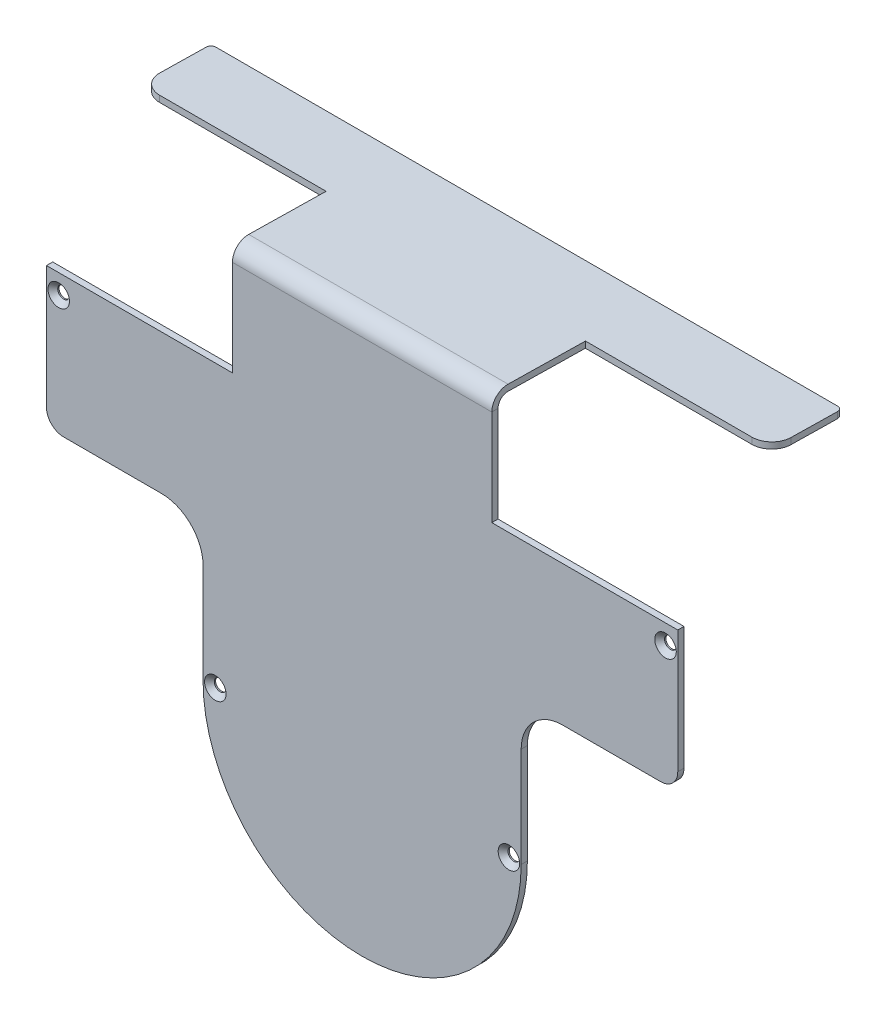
ISO-10303-21;
HEADER;
FILE_DESCRIPTION(('STEP AP214'),'2;1');
FILE_NAME('part.step','',(''),(''),'','','');
FILE_SCHEMA(('AUTOMOTIVE_DESIGN { 1 0 10303 214 1 1 1 1 }'));
ENDSEC;
DATA;
#1=APPLICATION_CONTEXT('core data for automotive mechanical design processes');
#2=APPLICATION_PROTOCOL_DEFINITION('international standard','automotive_design',2000,#1);
#3=PRODUCT_CONTEXT('',#1,'mechanical');
#4=PRODUCT('Part','Part','',(#3));
#5=PRODUCT_RELATED_PRODUCT_CATEGORY('part','',(#4));
#6=PRODUCT_DEFINITION_FORMATION('','',#4);
#7=PRODUCT_DEFINITION_CONTEXT('part definition',#1,'design');
#8=PRODUCT_DEFINITION('design','',#6,#7);
#9=PRODUCT_DEFINITION_SHAPE('','',#8);
#10=(LENGTH_UNIT() NAMED_UNIT(*) SI_UNIT(.MILLI.,.METRE.));
#11=(NAMED_UNIT(*) PLANE_ANGLE_UNIT() SI_UNIT($,.RADIAN.));
#12=(NAMED_UNIT(*) SI_UNIT($,.STERADIAN.) SOLID_ANGLE_UNIT());
#13=UNCERTAINTY_MEASURE_WITH_UNIT(LENGTH_MEASURE(1.E-05),#10,'distance_accuracy_value','');
#14=(GEOMETRIC_REPRESENTATION_CONTEXT(3) GLOBAL_UNCERTAINTY_ASSIGNED_CONTEXT((#13)) GLOBAL_UNIT_ASSIGNED_CONTEXT((#10,
#11,#12)) REPRESENTATION_CONTEXT('',''));
#15=CARTESIAN_POINT('',(0.,0.,0.));
#16=DIRECTION('',(0.,0.,1.));
#17=DIRECTION('',(1.,0.,0.));
#18=AXIS2_PLACEMENT_3D('',#15,#16,#17);
#19=CARTESIAN_POINT('',(0.,0.,1.27));
#20=DIRECTION('',(0.,0.,1.));
#21=DIRECTION('',(1.,0.,0.));
#22=AXIS2_PLACEMENT_3D('',#19,#20,#21);
#23=PLANE('',#22);
#24=CARTESIAN_POINT('',(-30.,0.,1.27));
#25=DIRECTION('',(0.,0.,1.));
#26=DIRECTION('',(1.,0.,0.));
#27=AXIS2_PLACEMENT_3D('',#24,#25,#26);
#28=CIRCLE('',#27,2.2);
#29=CARTESIAN_POINT('',(-27.8,0.,1.27));
#30=VERTEX_POINT('',#29);
#31=EDGE_CURVE('E256',#30,#30,#28,.T.);
#32=ORIENTED_EDGE('',*,*,#31,.F.);
#33=EDGE_LOOP('',(#32));
#34=FACE_BOUND('',#33,.T.);
#35=CARTESIAN_POINT('',(30.,0.,1.27));
#36=DIRECTION('',(0.,0.,1.));
#37=DIRECTION('',(1.,0.,0.));
#38=AXIS2_PLACEMENT_3D('',#35,#36,#37);
#39=CIRCLE('',#38,2.2);
#40=CARTESIAN_POINT('',(32.2,0.,1.27));
#41=VERTEX_POINT('',#40);
#42=EDGE_CURVE('E263',#41,#41,#39,.T.);
#43=ORIENTED_EDGE('',*,*,#42,.F.);
#44=EDGE_LOOP('',(#43));
#45=FACE_BOUND('',#44,.T.);
#46=CARTESIAN_POINT('',(-62.,53.5,1.27));
#47=DIRECTION('',(0.,0.,1.));
#48=DIRECTION('',(1.,0.,0.));
#49=AXIS2_PLACEMENT_3D('',#46,#47,#48);
#50=CIRCLE('',#49,2.2);
#51=CARTESIAN_POINT('',(-59.8,53.5,1.27));
#52=VERTEX_POINT('',#51);
#53=EDGE_CURVE('E270',#52,#52,#50,.T.);
#54=ORIENTED_EDGE('',*,*,#53,.F.);
#55=EDGE_LOOP('',(#54));
#56=FACE_BOUND('',#55,.T.);
#57=CARTESIAN_POINT('',(62.,53.5,1.27));
#58=DIRECTION('',(0.,0.,1.));
#59=DIRECTION('',(1.,0.,0.));
#60=AXIS2_PLACEMENT_3D('',#57,#58,#59);
#61=CIRCLE('',#60,2.2);
#62=CARTESIAN_POINT('',(64.2,53.5,1.27));
#63=VERTEX_POINT('',#62);
#64=EDGE_CURVE('E277',#63,#63,#61,.T.);
#65=ORIENTED_EDGE('',*,*,#64,.F.);
#66=EDGE_LOOP('',(#65));
#67=FACE_BOUND('',#66,.T.);
#68=DIRECTION('',(0.,1.,0.));
#69=VECTOR('',#68,1.);
#70=CARTESIAN_POINT('',(26.5,79.107,1.27));
#71=LINE('',#70,#69);
#72=CARTESIAN_POINT('',(26.5,57.5,1.27));
#73=VERTEX_POINT('',#72);
#74=CARTESIAN_POINT('',(26.5,77.0717852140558,1.26999999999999));
#75=VERTEX_POINT('',#74);
#76=EDGE_CURVE('E305',#73,#75,#71,.T.);
#77=ORIENTED_EDGE('',*,*,#76,.T.);
#78=DIRECTION('',(1.,0.,0.));
#79=VECTOR('',#78,1.);
#80=CARTESIAN_POINT('',(26.5,77.0717852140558,1.26999999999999));
#81=LINE('',#80,#79);
#82=CARTESIAN_POINT('',(-26.5,77.0717852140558,1.27));
#83=VERTEX_POINT('',#82);
#84=EDGE_CURVE('E286',#75,#83,#81,.F.);
#85=ORIENTED_EDGE('',*,*,#84,.T.);
#86=DIRECTION('',(0.,-1.,0.));
#87=VECTOR('',#86,1.);
#88=CARTESIAN_POINT('',(-26.5,79.107,1.27));
#89=LINE('',#88,#87);
#90=CARTESIAN_POINT('',(-26.5,57.5,1.27));
#91=VERTEX_POINT('',#90);
#92=EDGE_CURVE('E323',#83,#91,#89,.T.);
#93=ORIENTED_EDGE('',*,*,#92,.T.);
#94=DIRECTION('',(-1.,0.,0.));
#95=VECTOR('',#94,1.);
#96=CARTESIAN_POINT('',(-26.5,57.5,1.27));
#97=LINE('',#96,#95);
#98=CARTESIAN_POINT('',(-64.5000494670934,57.5,1.27));
#99=VERTEX_POINT('',#98);
#100=EDGE_CURVE('E325',#91,#99,#97,.T.);
#101=ORIENTED_EDGE('',*,*,#100,.T.);
#102=DIRECTION('',(0.,-1.,0.));
#103=VECTOR('',#102,1.);
#104=CARTESIAN_POINT('',(-64.5000494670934,32.40952187,1.27));
#105=LINE('',#104,#103);
#106=CARTESIAN_POINT('',(-64.5000494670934,32.40952187,1.27));
#107=VERTEX_POINT('',#106);
#108=EDGE_CURVE('E355',#99,#107,#105,.T.);
#109=ORIENTED_EDGE('',*,*,#108,.T.);
#110=CARTESIAN_POINT('',(-61.0000494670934,32.40952187,1.27));
#111=DIRECTION('',(0.,0.,1.));
#112=DIRECTION('',(-1.,0.,0.));
#113=AXIS2_PLACEMENT_3D('',#110,#111,#112);
#114=CIRCLE('',#113,3.5);
#115=CARTESIAN_POINT('',(-61.0000494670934,28.90952187,1.27));
#116=VERTEX_POINT('',#115);
#117=EDGE_CURVE('E357',#107,#116,#114,.T.);
#118=ORIENTED_EDGE('',*,*,#117,.T.);
#119=DIRECTION('',(1.,0.,0.));
#120=VECTOR('',#119,1.);
#121=CARTESIAN_POINT('',(-41.,28.90952187,1.27));
#122=LINE('',#121,#120);
#123=CARTESIAN_POINT('',(-41.,28.90952187,1.27));
#124=VERTEX_POINT('',#123);
#125=EDGE_CURVE('E359',#116,#124,#122,.T.);
#126=ORIENTED_EDGE('',*,*,#125,.T.);
#127=CARTESIAN_POINT('',(-41.,20.40952187,1.27));
#128=DIRECTION('',(0.,0.,-1.));
#129=DIRECTION('',(-1.,0.,0.));
#130=AXIS2_PLACEMENT_3D('',#127,#128,#129);
#131=CIRCLE('',#130,8.5);
#132=CARTESIAN_POINT('',(-32.5,20.40952187,1.27));
#133=VERTEX_POINT('',#132);
#134=EDGE_CURVE('E361',#124,#133,#131,.T.);
#135=ORIENTED_EDGE('',*,*,#134,.T.);
#136=DIRECTION('',(0.,-1.,0.));
#137=VECTOR('',#136,1.);
#138=CARTESIAN_POINT('',(-32.5,0.,1.27));
#139=LINE('',#138,#137);
#140=CARTESIAN_POINT('',(-32.5,0.,1.27));
#141=VERTEX_POINT('',#140);
#142=EDGE_CURVE('E363',#133,#141,#139,.T.);
#143=ORIENTED_EDGE('',*,*,#142,.T.);
#144=CARTESIAN_POINT('',(0.,0.,1.27));
#145=DIRECTION('',(0.,0.,1.));
#146=DIRECTION('',(1.,0.,0.));
#147=AXIS2_PLACEMENT_3D('',#144,#145,#146);
#148=CIRCLE('',#147,32.5);
#149=CARTESIAN_POINT('',(32.5,0.,1.27));
#150=VERTEX_POINT('',#149);
#151=EDGE_CURVE('E341',#141,#150,#148,.T.);
#152=ORIENTED_EDGE('',*,*,#151,.T.);
#153=DIRECTION('',(0.,1.,0.));
#154=VECTOR('',#153,1.);
#155=CARTESIAN_POINT('',(32.5,0.,1.27));
#156=LINE('',#155,#154);
#157=CARTESIAN_POINT('',(32.5,20.40952187,1.27));
#158=VERTEX_POINT('',#157);
#159=EDGE_CURVE('E344',#150,#158,#156,.T.);
#160=ORIENTED_EDGE('',*,*,#159,.T.);
#161=CARTESIAN_POINT('',(41.,20.40952187,1.27));
#162=DIRECTION('',(0.,0.,-1.));
#163=DIRECTION('',(1.,0.,0.));
#164=AXIS2_PLACEMENT_3D('',#161,#162,#163);
#165=CIRCLE('',#164,8.5);
#166=CARTESIAN_POINT('',(41.,28.90952187,1.27));
#167=VERTEX_POINT('',#166);
#168=EDGE_CURVE('E347',#158,#167,#165,.T.);
#169=ORIENTED_EDGE('',*,*,#168,.T.);
#170=DIRECTION('',(1.,0.,0.));
#171=VECTOR('',#170,1.);
#172=CARTESIAN_POINT('',(41.,28.90952187,1.27));
#173=LINE('',#172,#171);
#174=CARTESIAN_POINT('',(61.0000494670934,28.90952187,1.27));
#175=VERTEX_POINT('',#174);
#176=EDGE_CURVE('E349',#167,#175,#173,.T.);
#177=ORIENTED_EDGE('',*,*,#176,.T.);
#178=CARTESIAN_POINT('',(61.0000494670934,32.40952187,1.27));
#179=DIRECTION('',(0.,0.,1.));
#180=DIRECTION('',(1.,0.,0.));
#181=AXIS2_PLACEMENT_3D('',#178,#179,#180);
#182=CIRCLE('',#181,3.5);
#183=CARTESIAN_POINT('',(64.5000494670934,32.40952187,1.27));
#184=VERTEX_POINT('',#183);
#185=EDGE_CURVE('E351',#175,#184,#182,.T.);
#186=ORIENTED_EDGE('',*,*,#185,.T.);
#187=DIRECTION('',(0.,1.,0.));
#188=VECTOR('',#187,1.);
#189=CARTESIAN_POINT('',(64.5000494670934,32.40952187,1.27));
#190=LINE('',#189,#188);
#191=CARTESIAN_POINT('',(64.5000494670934,57.5,1.27));
#192=VERTEX_POINT('',#191);
#193=EDGE_CURVE('E353',#184,#192,#190,.T.);
#194=ORIENTED_EDGE('',*,*,#193,.T.);
#195=DIRECTION('',(-1.,0.,0.));
#196=VECTOR('',#195,1.);
#197=CARTESIAN_POINT('',(26.5,57.5,1.27));
#198=LINE('',#197,#196);
#199=EDGE_CURVE('E312',#192,#73,#198,.T.);
#200=ORIENTED_EDGE('',*,*,#199,.T.);
#201=EDGE_LOOP('',(#77,#85,#93,#101,#109,#118,#126,#135,#143,#152,#160,#169,#177,#186,#194,#200));
#202=FACE_BOUND('',#201,.T.);
#203=ADVANCED_FACE('F16',(#34,#45,#56,#67,#202),#23,.T.);
#204=CARTESIAN_POINT('',(0.,0.,0.));
#205=DIRECTION('',(0.,0.,1.));
#206=DIRECTION('',(1.,0.,0.));
#207=AXIS2_PLACEMENT_3D('',#204,#205,#206);
#208=PLANE('',#207);
#209=CARTESIAN_POINT('',(-30.,0.,0.));
#210=DIRECTION('',(0.,0.,1.));
#211=DIRECTION('',(1.,0.,0.));
#212=AXIS2_PLACEMENT_3D('',#209,#210,#211);
#213=CIRCLE('',#212,1.19999999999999);
#214=CARTESIAN_POINT('',(-28.8,0.,0.));
#215=VERTEX_POINT('',#214);
#216=EDGE_CURVE('E259',#215,#215,#213,.T.);
#217=ORIENTED_EDGE('',*,*,#216,.T.);
#218=EDGE_LOOP('',(#217));
#219=FACE_BOUND('',#218,.T.);
#220=CARTESIAN_POINT('',(30.,0.,0.));
#221=DIRECTION('',(0.,0.,1.));
#222=DIRECTION('',(1.,0.,0.));
#223=AXIS2_PLACEMENT_3D('',#220,#221,#222);
#224=CIRCLE('',#223,1.19999999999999);
#225=CARTESIAN_POINT('',(31.2,0.,0.));
#226=VERTEX_POINT('',#225);
#227=EDGE_CURVE('E266',#226,#226,#224,.T.);
#228=ORIENTED_EDGE('',*,*,#227,.T.);
#229=EDGE_LOOP('',(#228));
#230=FACE_BOUND('',#229,.T.);
#231=CARTESIAN_POINT('',(-62.,53.5,0.));
#232=DIRECTION('',(0.,0.,1.));
#233=DIRECTION('',(1.,0.,0.));
#234=AXIS2_PLACEMENT_3D('',#231,#232,#233);
#235=CIRCLE('',#234,1.19999999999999);
#236=CARTESIAN_POINT('',(-60.8,53.5,0.));
#237=VERTEX_POINT('',#236);
#238=EDGE_CURVE('E273',#237,#237,#235,.T.);
#239=ORIENTED_EDGE('',*,*,#238,.T.);
#240=EDGE_LOOP('',(#239));
#241=FACE_BOUND('',#240,.T.);
#242=CARTESIAN_POINT('',(62.,53.5,0.));
#243=DIRECTION('',(0.,0.,1.));
#244=DIRECTION('',(1.,0.,0.));
#245=AXIS2_PLACEMENT_3D('',#242,#243,#244);
#246=CIRCLE('',#245,1.19999999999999);
#247=CARTESIAN_POINT('',(63.2,53.5,0.));
#248=VERTEX_POINT('',#247);
#249=EDGE_CURVE('E280',#248,#248,#246,.T.);
#250=ORIENTED_EDGE('',*,*,#249,.T.);
#251=EDGE_LOOP('',(#250));
#252=FACE_BOUND('',#251,.T.);
#253=DIRECTION('',(1.,0.,0.));
#254=VECTOR('',#253,1.);
#255=CARTESIAN_POINT('',(26.5,77.0717852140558,0.));
#256=LINE('',#255,#254);
#257=CARTESIAN_POINT('',(26.5,77.0717852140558,0.));
#258=VERTEX_POINT('',#257);
#259=CARTESIAN_POINT('',(-26.5,77.0717852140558,0.));
#260=VERTEX_POINT('',#259);
#261=EDGE_CURVE('E298',#258,#260,#256,.F.);
#262=ORIENTED_EDGE('',*,*,#261,.F.);
#263=DIRECTION('',(0.,1.,0.));
#264=VECTOR('',#263,1.);
#265=CARTESIAN_POINT('',(26.5,79.107,0.));
#266=LINE('',#265,#264);
#267=CARTESIAN_POINT('',(26.5,57.5,0.));
#268=VERTEX_POINT('',#267);
#269=EDGE_CURVE('E308',#268,#258,#266,.T.);
#270=ORIENTED_EDGE('',*,*,#269,.F.);
#271=DIRECTION('',(-1.,0.,0.));
#272=VECTOR('',#271,1.);
#273=CARTESIAN_POINT('',(26.5,57.5,0.));
#274=LINE('',#273,#272);
#275=CARTESIAN_POINT('',(64.5000494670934,57.5,0.));
#276=VERTEX_POINT('',#275);
#277=EDGE_CURVE('E317',#276,#268,#274,.T.);
#278=ORIENTED_EDGE('',*,*,#277,.F.);
#279=DIRECTION('',(0.,1.,0.));
#280=VECTOR('',#279,1.);
#281=CARTESIAN_POINT('',(64.5000494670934,32.40952187,0.));
#282=LINE('',#281,#280);
#283=CARTESIAN_POINT('',(64.5000494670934,32.40952187,0.));
#284=VERTEX_POINT('',#283);
#285=EDGE_CURVE('E376',#284,#276,#282,.T.);
#286=ORIENTED_EDGE('',*,*,#285,.F.);
#287=CARTESIAN_POINT('',(61.0000494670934,32.40952187,0.));
#288=DIRECTION('',(0.,0.,1.));
#289=DIRECTION('',(1.,0.,0.));
#290=AXIS2_PLACEMENT_3D('',#287,#288,#289);
#291=CIRCLE('',#290,3.5);
#292=CARTESIAN_POINT('',(61.0000494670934,28.90952187,0.));
#293=VERTEX_POINT('',#292);
#294=EDGE_CURVE('E374',#293,#284,#291,.T.);
#295=ORIENTED_EDGE('',*,*,#294,.F.);
#296=DIRECTION('',(1.,0.,0.));
#297=VECTOR('',#296,1.);
#298=CARTESIAN_POINT('',(41.,28.90952187,0.));
#299=LINE('',#298,#297);
#300=CARTESIAN_POINT('',(41.,28.90952187,0.));
#301=VERTEX_POINT('',#300);
#302=EDGE_CURVE('E372',#301,#293,#299,.T.);
#303=ORIENTED_EDGE('',*,*,#302,.F.);
#304=CARTESIAN_POINT('',(41.,20.40952187,0.));
#305=DIRECTION('',(0.,0.,-1.));
#306=DIRECTION('',(1.,0.,0.));
#307=AXIS2_PLACEMENT_3D('',#304,#305,#306);
#308=CIRCLE('',#307,8.5);
#309=CARTESIAN_POINT('',(32.5,20.40952187,0.));
#310=VERTEX_POINT('',#309);
#311=EDGE_CURVE('E370',#310,#301,#308,.T.);
#312=ORIENTED_EDGE('',*,*,#311,.F.);
#313=DIRECTION('',(0.,1.,0.));
#314=VECTOR('',#313,1.);
#315=CARTESIAN_POINT('',(32.5,0.,0.));
#316=LINE('',#315,#314);
#317=CARTESIAN_POINT('',(32.5,0.,0.));
#318=VERTEX_POINT('',#317);
#319=EDGE_CURVE('E368',#318,#310,#316,.T.);
#320=ORIENTED_EDGE('',*,*,#319,.F.);
#321=CARTESIAN_POINT('',(0.,0.,0.));
#322=DIRECTION('',(0.,0.,1.));
#323=DIRECTION('',(1.,0.,0.));
#324=AXIS2_PLACEMENT_3D('',#321,#322,#323);
#325=CIRCLE('',#324,32.5);
#326=CARTESIAN_POINT('',(-32.5,0.,0.));
#327=VERTEX_POINT('',#326);
#328=EDGE_CURVE('E332',#327,#318,#325,.T.);
#329=ORIENTED_EDGE('',*,*,#328,.F.);
#330=DIRECTION('',(0.,-1.,0.));
#331=VECTOR('',#330,1.);
#332=CARTESIAN_POINT('',(-32.5,0.,0.));
#333=LINE('',#332,#331);
#334=CARTESIAN_POINT('',(-32.5,20.40952187,0.));
#335=VERTEX_POINT('',#334);
#336=EDGE_CURVE('E345',#335,#327,#333,.T.);
#337=ORIENTED_EDGE('',*,*,#336,.F.);
#338=CARTESIAN_POINT('',(-41.,20.40952187,0.));
#339=DIRECTION('',(0.,0.,-1.));
#340=DIRECTION('',(-1.,0.,0.));
#341=AXIS2_PLACEMENT_3D('',#338,#339,#340);
#342=CIRCLE('',#341,8.5);
#343=CARTESIAN_POINT('',(-41.,28.90952187,0.));
#344=VERTEX_POINT('',#343);
#345=EDGE_CURVE('E384',#344,#335,#342,.T.);
#346=ORIENTED_EDGE('',*,*,#345,.F.);
#347=DIRECTION('',(1.,0.,0.));
#348=VECTOR('',#347,1.);
#349=CARTESIAN_POINT('',(-41.,28.90952187,0.));
#350=LINE('',#349,#348);
#351=CARTESIAN_POINT('',(-61.0000494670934,28.90952187,0.));
#352=VERTEX_POINT('',#351);
#353=EDGE_CURVE('E382',#352,#344,#350,.T.);
#354=ORIENTED_EDGE('',*,*,#353,.F.);
#355=CARTESIAN_POINT('',(-61.0000494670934,32.40952187,0.));
#356=DIRECTION('',(0.,0.,1.));
#357=DIRECTION('',(-1.,0.,0.));
#358=AXIS2_PLACEMENT_3D('',#355,#356,#357);
#359=CIRCLE('',#358,3.5);
#360=CARTESIAN_POINT('',(-64.5000494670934,32.40952187,0.));
#361=VERTEX_POINT('',#360);
#362=EDGE_CURVE('E380',#361,#352,#359,.T.);
#363=ORIENTED_EDGE('',*,*,#362,.F.);
#364=DIRECTION('',(0.,-1.,0.));
#365=VECTOR('',#364,1.);
#366=CARTESIAN_POINT('',(-64.5000494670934,32.40952187,0.));
#367=LINE('',#366,#365);
#368=CARTESIAN_POINT('',(-64.5000494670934,57.5,0.));
#369=VERTEX_POINT('',#368);
#370=EDGE_CURVE('E378',#369,#361,#367,.T.);
#371=ORIENTED_EDGE('',*,*,#370,.F.);
#372=DIRECTION('',(-1.,0.,0.));
#373=VECTOR('',#372,1.);
#374=CARTESIAN_POINT('',(-26.5,57.5,0.));
#375=LINE('',#374,#373);
#376=CARTESIAN_POINT('',(-26.5,57.5,0.));
#377=VERTEX_POINT('',#376);
#378=EDGE_CURVE('E314',#377,#369,#375,.T.);
#379=ORIENTED_EDGE('',*,*,#378,.F.);
#380=DIRECTION('',(0.,-1.,0.));
#381=VECTOR('',#380,1.);
#382=CARTESIAN_POINT('',(-26.5,79.107,0.));
#383=LINE('',#382,#381);
#384=EDGE_CURVE('E311',#260,#377,#383,.T.);
#385=ORIENTED_EDGE('',*,*,#384,.F.);
#386=EDGE_LOOP('',(#262,#270,#278,#286,#295,#303,#312,#320,#329,#337,#346,#354,#363,#371,#379,#385));
#387=FACE_BOUND('',#386,.T.);
#388=ADVANCED_FACE('F496',(#219,#230,#241,#252,#387),#208,.F.);
#389=CARTESIAN_POINT('',(26.5,79.107,0.));
#390=DIRECTION('',(1.,0.,0.));
#391=DIRECTION('',(0.,1.,0.));
#392=AXIS2_PLACEMENT_3D('',#389,#390,#391);
#393=PLANE('',#392);
#394=ORIENTED_EDGE('',*,*,#269,.T.);
#395=DIRECTION('',(0.,0.,1.));
#396=VECTOR('',#395,1.);
#397=CARTESIAN_POINT('',(26.5,77.0717852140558,0.));
#398=LINE('',#397,#396);
#399=EDGE_CURVE('E293',#258,#75,#398,.T.);
#400=ORIENTED_EDGE('',*,*,#399,.T.);
#401=ORIENTED_EDGE('',*,*,#76,.F.);
#402=DIRECTION('',(0.,0.,1.));
#403=VECTOR('',#402,1.);
#404=CARTESIAN_POINT('',(26.5,57.5,0.));
#405=LINE('',#404,#403);
#406=EDGE_CURVE('E330',#268,#73,#405,.T.);
#407=ORIENTED_EDGE('',*,*,#406,.F.);
#408=EDGE_LOOP('',(#394,#400,#401,#407));
#409=FACE_BOUND('',#408,.T.);
#410=ADVANCED_FACE('F491',(#409),#393,.T.);
#411=CARTESIAN_POINT('',(0.,0.,1.27));
#412=DIRECTION('',(0.,0.,-1.));
#413=DIRECTION('',(-1.,0.,0.));
#414=AXIS2_PLACEMENT_3D('',#411,#412,#413);
#415=CYLINDRICAL_SURFACE('',#414,32.5);
#416=ORIENTED_EDGE('',*,*,#328,.T.);
#417=DIRECTION('',(0.,0.,-1.));
#418=VECTOR('',#417,1.);
#419=CARTESIAN_POINT('',(32.5,0.,1.27));
#420=LINE('',#419,#418);
#421=EDGE_CURVE('E413',#150,#318,#420,.T.);
#422=ORIENTED_EDGE('',*,*,#421,.F.);
#423=ORIENTED_EDGE('',*,*,#151,.F.);
#424=DIRECTION('',(0.,0.,-1.));
#425=VECTOR('',#424,1.);
#426=CARTESIAN_POINT('',(-32.5,0.,1.27));
#427=LINE('',#426,#425);
#428=EDGE_CURVE('E365',#141,#327,#427,.T.);
#429=ORIENTED_EDGE('',*,*,#428,.T.);
#430=EDGE_LOOP('',(#416,#422,#423,#429));
#431=FACE_BOUND('',#430,.T.);
#432=ADVANCED_FACE('F528',(#431),#415,.T.);
#433=CARTESIAN_POINT('',(32.5,0.,1.27));
#434=DIRECTION('',(-1.,0.,0.));
#435=DIRECTION('',(0.,0.,1.));
#436=AXIS2_PLACEMENT_3D('',#433,#434,#435);
#437=PLANE('',#436);
#438=ORIENTED_EDGE('',*,*,#319,.T.);
#439=DIRECTION('',(0.,0.,-1.));
#440=VECTOR('',#439,1.);
#441=CARTESIAN_POINT('',(32.5,20.40952187,1.27));
#442=LINE('',#441,#440);
#443=EDGE_CURVE('E410',#158,#310,#442,.T.);
#444=ORIENTED_EDGE('',*,*,#443,.F.);
#445=ORIENTED_EDGE('',*,*,#159,.F.);
#446=ORIENTED_EDGE('',*,*,#421,.T.);
#447=EDGE_LOOP('',(#438,#444,#445,#446));
#448=FACE_BOUND('',#447,.T.);
#449=ADVANCED_FACE('F525',(#448),#437,.F.);
#450=CARTESIAN_POINT('',(41.,20.40952187,1.27));
#451=DIRECTION('',(0.,0.,-1.));
#452=DIRECTION('',(-1.,0.,0.));
#453=AXIS2_PLACEMENT_3D('',#450,#451,#452);
#454=CYLINDRICAL_SURFACE('',#453,8.5);
#455=ORIENTED_EDGE('',*,*,#311,.T.);
#456=DIRECTION('',(0.,0.,-1.));
#457=VECTOR('',#456,1.);
#458=CARTESIAN_POINT('',(41.,28.90952187,1.27));
#459=LINE('',#458,#457);
#460=EDGE_CURVE('E407',#167,#301,#459,.T.);
#461=ORIENTED_EDGE('',*,*,#460,.F.);
#462=ORIENTED_EDGE('',*,*,#168,.F.);
#463=ORIENTED_EDGE('',*,*,#443,.T.);
#464=EDGE_LOOP('',(#455,#461,#462,#463));
#465=FACE_BOUND('',#464,.T.);
#466=ADVANCED_FACE('F519',(#465),#454,.F.);
#467=CARTESIAN_POINT('',(41.,28.90952187,1.27));
#468=DIRECTION('',(0.,1.,0.));
#469=DIRECTION('',(-1.,0.,0.));
#470=AXIS2_PLACEMENT_3D('',#467,#468,#469);
#471=PLANE('',#470);
#472=ORIENTED_EDGE('',*,*,#302,.T.);
#473=DIRECTION('',(0.,0.,-1.));
#474=VECTOR('',#473,1.);
#475=CARTESIAN_POINT('',(61.0000494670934,28.90952187,1.27));
#476=LINE('',#475,#474);
#477=EDGE_CURVE('E404',#175,#293,#476,.T.);
#478=ORIENTED_EDGE('',*,*,#477,.F.);
#479=ORIENTED_EDGE('',*,*,#176,.F.);
#480=ORIENTED_EDGE('',*,*,#460,.T.);
#481=EDGE_LOOP('',(#472,#478,#479,#480));
#482=FACE_BOUND('',#481,.T.);
#483=ADVANCED_FACE('F515',(#482),#471,.F.);
#484=CARTESIAN_POINT('',(61.0000494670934,32.40952187,1.27));
#485=DIRECTION('',(0.,0.,-1.));
#486=DIRECTION('',(-1.,0.,0.));
#487=AXIS2_PLACEMENT_3D('',#484,#485,#486);
#488=CYLINDRICAL_SURFACE('',#487,3.5);
#489=ORIENTED_EDGE('',*,*,#294,.T.);
#490=DIRECTION('',(0.,0.,-1.));
#491=VECTOR('',#490,1.);
#492=CARTESIAN_POINT('',(64.5000494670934,32.40952187,1.27));
#493=LINE('',#492,#491);
#494=EDGE_CURVE('E401',#184,#284,#493,.T.);
#495=ORIENTED_EDGE('',*,*,#494,.F.);
#496=ORIENTED_EDGE('',*,*,#185,.F.);
#497=ORIENTED_EDGE('',*,*,#477,.T.);
#498=EDGE_LOOP('',(#489,#495,#496,#497));
#499=FACE_BOUND('',#498,.T.);
#500=ADVANCED_FACE('F510',(#499),#488,.T.);
#501=CARTESIAN_POINT('',(64.5000494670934,32.40952187,1.27));
#502=DIRECTION('',(-1.,0.,0.));
#503=DIRECTION('',(0.,0.,1.));
#504=AXIS2_PLACEMENT_3D('',#501,#502,#503);
#505=PLANE('',#504);
#506=ORIENTED_EDGE('',*,*,#285,.T.);
#507=DIRECTION('',(0.,0.,1.));
#508=VECTOR('',#507,1.);
#509=CARTESIAN_POINT('',(64.5000494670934,57.5,0.));
#510=LINE('',#509,#508);
#511=EDGE_CURVE('E333',#276,#192,#510,.T.);
#512=ORIENTED_EDGE('',*,*,#511,.T.);
#513=ORIENTED_EDGE('',*,*,#193,.F.);
#514=ORIENTED_EDGE('',*,*,#494,.T.);
#515=EDGE_LOOP('',(#506,#512,#513,#514));
#516=FACE_BOUND('',#515,.T.);
#517=ADVANCED_FACE('F504',(#516),#505,.F.);
#518=CARTESIAN_POINT('',(-64.5000494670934,32.40952187,1.27));
#519=DIRECTION('',(1.,0.,0.));
#520=DIRECTION('',(0.,0.,-1.));
#521=AXIS2_PLACEMENT_3D('',#518,#519,#520);
#522=PLANE('',#521);
#523=ORIENTED_EDGE('',*,*,#370,.T.);
#524=DIRECTION('',(0.,0.,-1.));
#525=VECTOR('',#524,1.);
#526=CARTESIAN_POINT('',(-64.5000494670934,32.40952187,1.27));
#527=LINE('',#526,#525);
#528=EDGE_CURVE('E398',#107,#361,#527,.T.);
#529=ORIENTED_EDGE('',*,*,#528,.F.);
#530=ORIENTED_EDGE('',*,*,#108,.F.);
#531=DIRECTION('',(0.,0.,1.));
#532=VECTOR('',#531,1.);
#533=CARTESIAN_POINT('',(-64.5000494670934,57.5,0.));
#534=LINE('',#533,#532);
#535=EDGE_CURVE('E336',#369,#99,#534,.T.);
#536=ORIENTED_EDGE('',*,*,#535,.F.);
#537=EDGE_LOOP('',(#523,#529,#530,#536));
#538=FACE_BOUND('',#537,.T.);
#539=ADVANCED_FACE('F552',(#538),#522,.F.);
#540=CARTESIAN_POINT('',(-61.0000494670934,32.40952187,1.27));
#541=DIRECTION('',(0.,0.,-1.));
#542=DIRECTION('',(-1.,0.,0.));
#543=AXIS2_PLACEMENT_3D('',#540,#541,#542);
#544=CYLINDRICAL_SURFACE('',#543,3.5);
#545=ORIENTED_EDGE('',*,*,#362,.T.);
#546=DIRECTION('',(0.,0.,-1.));
#547=VECTOR('',#546,1.);
#548=CARTESIAN_POINT('',(-61.0000494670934,28.90952187,1.27));
#549=LINE('',#548,#547);
#550=EDGE_CURVE('E395',#116,#352,#549,.T.);
#551=ORIENTED_EDGE('',*,*,#550,.F.);
#552=ORIENTED_EDGE('',*,*,#117,.F.);
#553=ORIENTED_EDGE('',*,*,#528,.T.);
#554=EDGE_LOOP('',(#545,#551,#552,#553));
#555=FACE_BOUND('',#554,.T.);
#556=ADVANCED_FACE('F547',(#555),#544,.T.);
#557=CARTESIAN_POINT('',(-41.,28.90952187,1.27));
#558=DIRECTION('',(0.,1.,0.));
#559=DIRECTION('',(-1.,0.,0.));
#560=AXIS2_PLACEMENT_3D('',#557,#558,#559);
#561=PLANE('',#560);
#562=ORIENTED_EDGE('',*,*,#353,.T.);
#563=DIRECTION('',(0.,0.,-1.));
#564=VECTOR('',#563,1.);
#565=CARTESIAN_POINT('',(-41.,28.90952187,1.27));
#566=LINE('',#565,#564);
#567=EDGE_CURVE('E392',#124,#344,#566,.T.);
#568=ORIENTED_EDGE('',*,*,#567,.F.);
#569=ORIENTED_EDGE('',*,*,#125,.F.);
#570=ORIENTED_EDGE('',*,*,#550,.T.);
#571=EDGE_LOOP('',(#562,#568,#569,#570));
#572=FACE_BOUND('',#571,.T.);
#573=ADVANCED_FACE('F543',(#572),#561,.F.);
#574=CARTESIAN_POINT('',(-41.,20.40952187,1.27));
#575=DIRECTION('',(0.,0.,-1.));
#576=DIRECTION('',(-1.,0.,0.));
#577=AXIS2_PLACEMENT_3D('',#574,#575,#576);
#578=CYLINDRICAL_SURFACE('',#577,8.5);
#579=ORIENTED_EDGE('',*,*,#345,.T.);
#580=DIRECTION('',(0.,0.,-1.));
#581=VECTOR('',#580,1.);
#582=CARTESIAN_POINT('',(-32.5,20.40952187,1.27));
#583=LINE('',#582,#581);
#584=EDGE_CURVE('E389',#133,#335,#583,.T.);
#585=ORIENTED_EDGE('',*,*,#584,.F.);
#586=ORIENTED_EDGE('',*,*,#134,.F.);
#587=ORIENTED_EDGE('',*,*,#567,.T.);
#588=EDGE_LOOP('',(#579,#585,#586,#587));
#589=FACE_BOUND('',#588,.T.);
#590=ADVANCED_FACE('F538',(#589),#578,.F.);
#591=CARTESIAN_POINT('',(-32.5,0.,1.27));
#592=DIRECTION('',(1.,0.,0.));
#593=DIRECTION('',(0.,0.,-1.));
#594=AXIS2_PLACEMENT_3D('',#591,#592,#593);
#595=PLANE('',#594);
#596=ORIENTED_EDGE('',*,*,#336,.T.);
#597=ORIENTED_EDGE('',*,*,#428,.F.);
#598=ORIENTED_EDGE('',*,*,#142,.F.);
#599=ORIENTED_EDGE('',*,*,#584,.T.);
#600=EDGE_LOOP('',(#596,#597,#598,#599));
#601=FACE_BOUND('',#600,.T.);
#602=ADVANCED_FACE('F532',(#601),#595,.F.);
#603=CARTESIAN_POINT('',(26.5,57.5,0.));
#604=DIRECTION('',(0.,1.,0.));
#605=DIRECTION('',(-1.,0.,0.));
#606=AXIS2_PLACEMENT_3D('',#603,#604,#605);
#607=PLANE('',#606);
#608=ORIENTED_EDGE('',*,*,#199,.F.);
#609=ORIENTED_EDGE('',*,*,#511,.F.);
#610=ORIENTED_EDGE('',*,*,#277,.T.);
#611=ORIENTED_EDGE('',*,*,#406,.T.);
#612=EDGE_LOOP('',(#608,#609,#610,#611));
#613=FACE_BOUND('',#612,.T.);
#614=ADVANCED_FACE('F501',(#613),#607,.T.);
#615=CARTESIAN_POINT('',(-26.5,57.5,0.));
#616=DIRECTION('',(0.,1.,0.));
#617=DIRECTION('',(-1.,0.,0.));
#618=AXIS2_PLACEMENT_3D('',#615,#616,#617);
#619=PLANE('',#618);
#620=ORIENTED_EDGE('',*,*,#100,.F.);
#621=DIRECTION('',(0.,0.,1.));
#622=VECTOR('',#621,1.);
#623=CARTESIAN_POINT('',(-26.5,57.5,0.));
#624=LINE('',#623,#622);
#625=EDGE_CURVE('E320',#377,#91,#624,.T.);
#626=ORIENTED_EDGE('',*,*,#625,.F.);
#627=ORIENTED_EDGE('',*,*,#378,.T.);
#628=ORIENTED_EDGE('',*,*,#535,.T.);
#629=EDGE_LOOP('',(#620,#626,#627,#628));
#630=FACE_BOUND('',#629,.T.);
#631=ADVANCED_FACE('F554',(#630),#619,.T.);
#632=CARTESIAN_POINT('',(-26.5,79.107,0.));
#633=DIRECTION('',(-1.,0.,0.));
#634=DIRECTION('',(0.,-1.,0.));
#635=AXIS2_PLACEMENT_3D('',#632,#633,#634);
#636=PLANE('',#635);
#637=DIRECTION('',(0.,0.,1.));
#638=VECTOR('',#637,1.);
#639=CARTESIAN_POINT('',(-26.5,77.0717852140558,0.));
#640=LINE('',#639,#638);
#641=EDGE_CURVE('E302',#260,#83,#640,.T.);
#642=ORIENTED_EDGE('',*,*,#641,.F.);
#643=ORIENTED_EDGE('',*,*,#384,.T.);
#644=ORIENTED_EDGE('',*,*,#625,.T.);
#645=ORIENTED_EDGE('',*,*,#92,.F.);
#646=EDGE_LOOP('',(#642,#643,#644,#645));
#647=FACE_BOUND('',#646,.T.);
#648=ADVANCED_FACE('F485',(#647),#636,.T.);
#649=CARTESIAN_POINT('',(-26.5,77.0717852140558,-2.));
#650=DIRECTION('',(-1.,0.,0.));
#651=DIRECTION('',(0.,0.,1.));
#652=AXIS2_PLACEMENT_3D('',#649,#650,#651);
#653=PLANE('',#652);
#654=CARTESIAN_POINT('',(-26.5,77.0717852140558,-2.));
#655=DIRECTION('',(1.,0.,0.));
#656=DIRECTION('',(0.,0.,-1.));
#657=AXIS2_PLACEMENT_3D('',#654,#655,#656);
#658=CIRCLE('',#657,3.27);
#659=CARTESIAN_POINT('',(-26.5,80.3412871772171,-2.05706936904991));
#660=VERTEX_POINT('',#659);
#661=EDGE_CURVE('E289',#83,#660,#658,.F.);
#662=ORIENTED_EDGE('',*,*,#661,.T.);
#663=DIRECTION('',(0.,-0.0174524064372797,-0.999847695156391));
#664=VECTOR('',#663,1.);
#665=CARTESIAN_POINT('',(-26.5,80.3412871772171,-2.05706936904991));
#666=LINE('',#665,#664);
#667=CARTESIAN_POINT('',(-26.5,80.0653052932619,-17.868060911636));
#668=VERTEX_POINT('',#667);
#669=EDGE_CURVE('E229',#660,#668,#666,.T.);
#670=ORIENTED_EDGE('',*,*,#669,.T.);
#671=DIRECTION('',(0.,0.999847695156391,-0.0174524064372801));
#672=VECTOR('',#671,1.);
#673=CARTESIAN_POINT('',(-26.5,-32.799668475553,-15.8979954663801));
#674=LINE('',#673,#672);
#675=CARTESIAN_POINT('',(-26.5,78.7954987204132,-17.8458963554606));
#676=VERTEX_POINT('',#675);
#677=EDGE_CURVE('E234',#676,#668,#674,.T.);
#678=ORIENTED_EDGE('',*,*,#677,.F.);
#679=DIRECTION('',(0.,0.0174524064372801,0.999847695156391));
#680=VECTOR('',#679,1.);
#681=CARTESIAN_POINT('',(-26.5,79.107,0.));
#682=LINE('',#681,#680);
#683=CARTESIAN_POINT('',(-26.5,79.0714806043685,-2.03490481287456));
#684=VERTEX_POINT('',#683);
#685=EDGE_CURVE('E238',#676,#684,#682,.T.);
#686=ORIENTED_EDGE('',*,*,#685,.T.);
#687=CARTESIAN_POINT('',(-26.5,77.0717852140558,-2.));
#688=DIRECTION('',(1.,0.,0.));
#689=DIRECTION('',(0.,0.,-1.));
#690=AXIS2_PLACEMENT_3D('',#687,#688,#689);
#691=CIRCLE('',#690,2.);
#692=EDGE_CURVE('E295',#260,#684,#691,.F.);
#693=ORIENTED_EDGE('',*,*,#692,.F.);
#694=ORIENTED_EDGE('',*,*,#641,.T.);
#695=EDGE_LOOP('',(#662,#670,#678,#686,#693,#694));
#696=FACE_BOUND('',#695,.T.);
#697=ADVANCED_FACE('F479',(#696),#653,.T.);
#698=CARTESIAN_POINT('',(26.5,77.0717852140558,-2.));
#699=DIRECTION('',(-1.,0.,0.));
#700=DIRECTION('',(0.,0.,1.));
#701=AXIS2_PLACEMENT_3D('',#698,#699,#700);
#702=PLANE('',#701);
#703=CARTESIAN_POINT('',(26.5,77.0717852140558,-2.));
#704=DIRECTION('',(1.,0.,0.));
#705=DIRECTION('',(0.,0.,-1.));
#706=AXIS2_PLACEMENT_3D('',#703,#704,#705);
#707=CIRCLE('',#706,2.);
#708=CARTESIAN_POINT('',(26.5,79.0714806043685,-2.03490481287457));
#709=VERTEX_POINT('',#708);
#710=EDGE_CURVE('E285',#709,#258,#707,.T.);
#711=ORIENTED_EDGE('',*,*,#710,.F.);
#712=DIRECTION('',(0.,-0.0174524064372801,-0.999847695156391));
#713=VECTOR('',#712,1.);
#714=CARTESIAN_POINT('',(26.5,79.107,0.));
#715=LINE('',#714,#713);
#716=CARTESIAN_POINT('',(26.5,78.7954987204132,-17.8458963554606));
#717=VERTEX_POINT('',#716);
#718=EDGE_CURVE('E218',#709,#717,#715,.T.);
#719=ORIENTED_EDGE('',*,*,#718,.T.);
#720=DIRECTION('',(0.,0.999847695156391,-0.0174524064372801));
#721=VECTOR('',#720,1.);
#722=CARTESIAN_POINT('',(26.5,-32.799668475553,-15.8979954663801));
#723=LINE('',#722,#721);
#724=CARTESIAN_POINT('',(26.5,80.0653052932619,-17.868060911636));
#725=VERTEX_POINT('',#724);
#726=EDGE_CURVE('E205',#717,#725,#723,.T.);
#727=ORIENTED_EDGE('',*,*,#726,.T.);
#728=DIRECTION('',(0.,0.0174524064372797,0.999847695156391));
#729=VECTOR('',#728,1.);
#730=CARTESIAN_POINT('',(26.5,80.3412871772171,-2.05706936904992));
#731=LINE('',#730,#729);
#732=CARTESIAN_POINT('',(26.5,80.3412871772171,-2.05706936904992));
#733=VERTEX_POINT('',#732);
#734=EDGE_CURVE('E211',#725,#733,#731,.T.);
#735=ORIENTED_EDGE('',*,*,#734,.T.);
#736=CARTESIAN_POINT('',(26.5,77.0717852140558,-2.));
#737=DIRECTION('',(1.,0.,0.));
#738=DIRECTION('',(0.,0.,-1.));
#739=AXIS2_PLACEMENT_3D('',#736,#737,#738);
#740=CIRCLE('',#739,3.27);
#741=EDGE_CURVE('E290',#733,#75,#740,.T.);
#742=ORIENTED_EDGE('',*,*,#741,.T.);
#743=ORIENTED_EDGE('',*,*,#399,.F.);
#744=EDGE_LOOP('',(#711,#719,#727,#735,#742,#743));
#745=FACE_BOUND('',#744,.T.);
#746=ADVANCED_FACE('F215',(#745),#702,.F.);
#747=CARTESIAN_POINT('',(26.5,77.0717852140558,-2.));
#748=DIRECTION('',(1.,0.,0.));
#749=DIRECTION('',(0.,0.999847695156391,-0.0174524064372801));
#750=AXIS2_PLACEMENT_3D('',#747,#748,#749);
#751=CYLINDRICAL_SURFACE('',#750,3.27);
#752=ORIENTED_EDGE('',*,*,#84,.F.);
#753=ORIENTED_EDGE('',*,*,#741,.F.);
#754=DIRECTION('',(-1.,0.,0.));
#755=VECTOR('',#754,1.);
#756=CARTESIAN_POINT('',(26.5,80.3412871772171,-2.05706936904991));
#757=LINE('',#756,#755);
#758=EDGE_CURVE('E224',#733,#660,#757,.T.);
#759=ORIENTED_EDGE('',*,*,#758,.T.);
#760=ORIENTED_EDGE('',*,*,#661,.F.);
#761=EDGE_LOOP('',(#752,#753,#759,#760));
#762=FACE_BOUND('',#761,.T.);
#763=ADVANCED_FACE('F478',(#762),#751,.T.);
#764=CARTESIAN_POINT('',(26.5,77.0717852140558,-2.));
#765=DIRECTION('',(1.,0.,0.));
#766=DIRECTION('',(0.,0.999847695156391,-0.0174524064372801));
#767=AXIS2_PLACEMENT_3D('',#764,#765,#766);
#768=CYLINDRICAL_SURFACE('',#767,2.);
#769=ORIENTED_EDGE('',*,*,#261,.T.);
#770=ORIENTED_EDGE('',*,*,#692,.T.);
#771=DIRECTION('',(1.,0.,0.));
#772=VECTOR('',#771,1.);
#773=CARTESIAN_POINT('',(-26.5,79.0714806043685,-2.03490481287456));
#774=LINE('',#773,#772);
#775=EDGE_CURVE('E281',#684,#709,#774,.T.);
#776=ORIENTED_EDGE('',*,*,#775,.T.);
#777=ORIENTED_EDGE('',*,*,#710,.T.);
#778=EDGE_LOOP('',(#769,#770,#776,#777));
#779=FACE_BOUND('',#778,.T.);
#780=ADVANCED_FACE('F622',(#779),#768,.F.);
#781=CARTESIAN_POINT('',(26.5,80.3768065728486,-0.0221645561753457));
#782=DIRECTION('',(0.,-0.999847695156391,0.0174524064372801));
#783=DIRECTION('',(0.,-0.0174524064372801,-0.999847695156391));
#784=AXIS2_PLACEMENT_3D('',#781,#782,#783);
#785=PLANE('',#784);
#786=DIRECTION('',(-1.,0.,0.));
#787=VECTOR('',#786,1.);
#788=CARTESIAN_POINT('',(64.50004947,80.0653052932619,-17.868060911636));
#789=LINE('',#788,#787);
#790=CARTESIAN_POINT('',(60.50004947,80.0653052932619,-17.868060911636));
#791=VERTEX_POINT('',#790);
#792=EDGE_CURVE('E201',#791,#725,#789,.T.);
#793=ORIENTED_EDGE('',*,*,#792,.F.);
#794=CARTESIAN_POINT('',(60.50004947,79.9954956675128,-21.8674516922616));
#795=DIRECTION('',(0.,-0.999847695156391,0.0174524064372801));
#796=DIRECTION('',(0.,-0.0174524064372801,-0.999847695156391));
#797=AXIS2_PLACEMENT_3D('',#794,#795,#796);
#798=CIRCLE('',#797,4.);
#799=CARTESIAN_POINT('',(64.50004947,79.9954956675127,-21.8674516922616));
#800=VERTEX_POINT('',#799);
#801=EDGE_CURVE('E456',#791,#800,#798,.F.);
#802=ORIENTED_EDGE('',*,*,#801,.T.);
#803=DIRECTION('',(0.,0.0174524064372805,0.999847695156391));
#804=VECTOR('',#803,1.);
#805=CARTESIAN_POINT('',(64.50004947,80.3412871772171,-2.05706936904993));
#806=LINE('',#805,#804);
#807=CARTESIAN_POINT('',(64.50004947,79.8295514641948,-31.3743887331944));
#808=VERTEX_POINT('',#807);
#809=EDGE_CURVE('E245',#808,#800,#806,.T.);
#810=ORIENTED_EDGE('',*,*,#809,.F.);
#811=CARTESIAN_POINT('',(63.50004947,79.8295514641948,-31.3743887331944));
#812=DIRECTION('',(0.,-0.999847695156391,0.0174524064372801));
#813=DIRECTION('',(0.,-0.0174524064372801,-0.999847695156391));
#814=AXIS2_PLACEMENT_3D('',#811,#812,#813);
#815=CIRCLE('',#814,1.);
#816=CARTESIAN_POINT('',(63.50004947,79.8120990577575,-32.3742364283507));
#817=VERTEX_POINT('',#816);
#818=EDGE_CURVE('E433',#808,#817,#815,.F.);
#819=ORIENTED_EDGE('',*,*,#818,.T.);
#820=DIRECTION('',(1.,0.,0.));
#821=VECTOR('',#820,1.);
#822=CARTESIAN_POINT('',(64.50004947,79.8120990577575,-32.3742364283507));
#823=LINE('',#822,#821);
#824=CARTESIAN_POINT('',(-63.50004947,79.8120990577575,-32.3742364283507));
#825=VERTEX_POINT('',#824);
#826=EDGE_CURVE('E242',#825,#817,#823,.T.);
#827=ORIENTED_EDGE('',*,*,#826,.F.);
#828=CARTESIAN_POINT('',(-63.50004947,79.8295514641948,-31.3743887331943));
#829=DIRECTION('',(0.,-0.999847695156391,0.0174524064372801));
#830=DIRECTION('',(0.,-0.0174524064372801,-0.999847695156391));
#831=AXIS2_PLACEMENT_3D('',#828,#829,#830);
#832=CIRCLE('',#831,1.);
#833=CARTESIAN_POINT('',(-64.50004947,79.8295514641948,-31.3743887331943));
#834=VERTEX_POINT('',#833);
#835=EDGE_CURVE('E430',#825,#834,#832,.F.);
#836=ORIENTED_EDGE('',*,*,#835,.T.);
#837=DIRECTION('',(0.,-0.01745240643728,-0.999847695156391));
#838=VECTOR('',#837,1.);
#839=CARTESIAN_POINT('',(-64.50004947,79.8120990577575,-32.3742364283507));
#840=LINE('',#839,#838);
#841=CARTESIAN_POINT('',(-64.50004947,79.9954956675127,-21.8674516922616));
#842=VERTEX_POINT('',#841);
#843=EDGE_CURVE('E240',#842,#834,#840,.T.);
#844=ORIENTED_EDGE('',*,*,#843,.F.);
#845=CARTESIAN_POINT('',(-60.50004947,79.9954956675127,-21.8674516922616));
#846=DIRECTION('',(0.,-0.999847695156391,0.0174524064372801));
#847=DIRECTION('',(0.,-0.0174524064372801,-0.999847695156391));
#848=AXIS2_PLACEMENT_3D('',#845,#846,#847);
#849=CIRCLE('',#848,4.);
#850=CARTESIAN_POINT('',(-60.50004947,80.0653052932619,-17.868060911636));
#851=VERTEX_POINT('',#850);
#852=EDGE_CURVE('E31',#842,#851,#849,.F.);
#853=ORIENTED_EDGE('',*,*,#852,.T.);
#854=DIRECTION('',(-1.,0.,0.));
#855=VECTOR('',#854,1.);
#856=CARTESIAN_POINT('',(-64.50004947,80.0653052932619,-17.868060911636));
#857=LINE('',#856,#855);
#858=EDGE_CURVE('E232',#668,#851,#857,.T.);
#859=ORIENTED_EDGE('',*,*,#858,.F.);
#860=ORIENTED_EDGE('',*,*,#669,.F.);
#861=ORIENTED_EDGE('',*,*,#758,.F.);
#862=ORIENTED_EDGE('',*,*,#734,.F.);
#863=EDGE_LOOP('',(#793,#802,#810,#819,#827,#836,#844,#853,#859,#860,#861,#862));
#864=FACE_BOUND('',#863,.T.);
#865=ADVANCED_FACE('F222',(#864),#785,.F.);
#866=CARTESIAN_POINT('',(26.5,79.107,0.));
#867=DIRECTION('',(0.,-0.999847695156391,0.0174524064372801));
#868=DIRECTION('',(0.,-0.0174524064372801,-0.999847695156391));
#869=AXIS2_PLACEMENT_3D('',#866,#867,#868);
#870=PLANE('',#869);
#871=DIRECTION('',(0.,-0.0174524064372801,-0.999847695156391));
#872=VECTOR('',#871,1.);
#873=CARTESIAN_POINT('',(64.50004947,79.107,0.));
#874=LINE('',#873,#872);
#875=CARTESIAN_POINT('',(64.50004947,78.7256890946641,-21.8452871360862));
#876=VERTEX_POINT('',#875);
#877=CARTESIAN_POINT('',(64.50004947,78.5597448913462,-31.352224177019));
#878=VERTEX_POINT('',#877);
#879=EDGE_CURVE('E248',#876,#878,#874,.T.);
#880=ORIENTED_EDGE('',*,*,#879,.F.);
#881=CARTESIAN_POINT('',(60.50004947,78.7256890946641,-21.8452871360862));
#882=DIRECTION('',(0.,-0.999847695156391,0.0174524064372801));
#883=DIRECTION('',(0.,-0.0174524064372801,-0.999847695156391));
#884=AXIS2_PLACEMENT_3D('',#881,#882,#883);
#885=CIRCLE('',#884,4.);
#886=CARTESIAN_POINT('',(60.50004947,78.7954987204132,-17.8458963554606));
#887=VERTEX_POINT('',#886);
#888=EDGE_CURVE('E452',#876,#887,#885,.T.);
#889=ORIENTED_EDGE('',*,*,#888,.T.);
#890=DIRECTION('',(1.,0.,0.));
#891=VECTOR('',#890,1.);
#892=CARTESIAN_POINT('',(26.5,78.7954987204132,-17.8458963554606));
#893=LINE('',#892,#891);
#894=EDGE_CURVE('E219',#717,#887,#893,.T.);
#895=ORIENTED_EDGE('',*,*,#894,.F.);
#896=ORIENTED_EDGE('',*,*,#718,.F.);
#897=ORIENTED_EDGE('',*,*,#775,.F.);
#898=ORIENTED_EDGE('',*,*,#685,.F.);
#899=DIRECTION('',(1.,0.,0.));
#900=VECTOR('',#899,1.);
#901=CARTESIAN_POINT('',(26.5,78.7954987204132,-17.8458963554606));
#902=LINE('',#901,#900);
#903=CARTESIAN_POINT('',(-60.50004947,78.7954987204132,-17.8458963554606));
#904=VERTEX_POINT('',#903);
#905=EDGE_CURVE('E236',#904,#676,#902,.T.);
#906=ORIENTED_EDGE('',*,*,#905,.F.);
#907=CARTESIAN_POINT('',(-60.50004947,78.7256890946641,-21.8452871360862));
#908=DIRECTION('',(0.,-0.999847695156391,0.0174524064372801));
#909=DIRECTION('',(0.,-0.0174524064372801,-0.999847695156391));
#910=AXIS2_PLACEMENT_3D('',#907,#908,#909);
#911=CIRCLE('',#910,4.);
#912=CARTESIAN_POINT('',(-64.50004947,78.7256890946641,-21.8452871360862));
#913=VERTEX_POINT('',#912);
#914=EDGE_CURVE('E450',#904,#913,#911,.T.);
#915=ORIENTED_EDGE('',*,*,#914,.T.);
#916=DIRECTION('',(0.,0.0174524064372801,0.999847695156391));
#917=VECTOR('',#916,1.);
#918=CARTESIAN_POINT('',(-64.50004947,79.107,0.));
#919=LINE('',#918,#917);
#920=CARTESIAN_POINT('',(-64.50004947,78.5597448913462,-31.352224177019));
#921=VERTEX_POINT('',#920);
#922=EDGE_CURVE('E250',#921,#913,#919,.T.);
#923=ORIENTED_EDGE('',*,*,#922,.F.);
#924=CARTESIAN_POINT('',(-63.50004947,78.5597448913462,-31.352224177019));
#925=DIRECTION('',(0.,-0.999847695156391,0.0174524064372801));
#926=DIRECTION('',(0.,-0.0174524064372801,-0.999847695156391));
#927=AXIS2_PLACEMENT_3D('',#924,#925,#926);
#928=CIRCLE('',#927,1.);
#929=CARTESIAN_POINT('',(-63.50004947,78.5422924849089,-32.3520718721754));
#930=VERTEX_POINT('',#929);
#931=EDGE_CURVE('E440',#921,#930,#928,.T.);
#932=ORIENTED_EDGE('',*,*,#931,.T.);
#933=DIRECTION('',(-1.,0.,0.));
#934=VECTOR('',#933,1.);
#935=CARTESIAN_POINT('',(26.5,78.5422924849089,-32.3520718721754));
#936=LINE('',#935,#934);
#937=CARTESIAN_POINT('',(63.50004947,78.5422924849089,-32.3520718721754));
#938=VERTEX_POINT('',#937);
#939=EDGE_CURVE('E416',#938,#930,#936,.T.);
#940=ORIENTED_EDGE('',*,*,#939,.F.);
#941=CARTESIAN_POINT('',(63.50004947,78.5597448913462,-31.352224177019));
#942=DIRECTION('',(0.,-0.999847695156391,0.0174524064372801));
#943=DIRECTION('',(0.,-0.0174524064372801,-0.999847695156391));
#944=AXIS2_PLACEMENT_3D('',#941,#942,#943);
#945=CIRCLE('',#944,1.);
#946=EDGE_CURVE('E442',#938,#878,#945,.T.);
#947=ORIENTED_EDGE('',*,*,#946,.T.);
#948=EDGE_LOOP('',(#880,#889,#895,#896,#897,#898,#906,#915,#923,#932,#940,#947));
#949=FACE_BOUND('',#948,.T.);
#950=ADVANCED_FACE('F469',(#949),#870,.T.);
#951=CARTESIAN_POINT('',(62.,53.5,1.27));
#952=DIRECTION('',(0.,0.,1.));
#953=DIRECTION('',(1.,0.,0.));
#954=AXIS2_PLACEMENT_3D('',#951,#952,#953);
#955=CYLINDRICAL_SURFACE('',#954,1.19999999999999);
#956=CARTESIAN_POINT('',(62.,53.5,0.269999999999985));
#957=DIRECTION('',(0.,0.,1.));
#958=DIRECTION('',(1.,0.,0.));
#959=AXIS2_PLACEMENT_3D('',#956,#957,#958);
#960=CIRCLE('',#959,1.19999999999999);
#961=CARTESIAN_POINT('',(63.2,53.5,0.269999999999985));
#962=VERTEX_POINT('',#961);
#963=EDGE_CURVE('E274',#962,#962,#960,.T.);
#964=ORIENTED_EDGE('',*,*,#963,.T.);
#965=EDGE_LOOP('',(#964));
#966=FACE_BOUND('',#965,.T.);
#967=ORIENTED_EDGE('',*,*,#249,.F.);
#968=EDGE_LOOP('',(#967));
#969=FACE_BOUND('',#968,.T.);
#970=ADVANCED_FACE('F672',(#966,#969),#955,.F.);
#971=CARTESIAN_POINT('',(62.,53.5,1.27));
#972=DIRECTION('',(0.,0.,1.));
#973=DIRECTION('',(1.,0.,0.));
#974=AXIS2_PLACEMENT_3D('',#971,#972,#973);
#975=CONICAL_SURFACE('',#974,2.2,0.785398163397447);
#976=ORIENTED_EDGE('',*,*,#963,.F.);
#977=EDGE_LOOP('',(#976));
#978=FACE_BOUND('',#977,.T.);
#979=ORIENTED_EDGE('',*,*,#64,.T.);
#980=EDGE_LOOP('',(#979));
#981=FACE_BOUND('',#980,.T.);
#982=ADVANCED_FACE('F681',(#978,#981),#975,.F.);
#983=CARTESIAN_POINT('',(-62.,53.5,1.27));
#984=DIRECTION('',(0.,0.,1.));
#985=DIRECTION('',(1.,0.,0.));
#986=AXIS2_PLACEMENT_3D('',#983,#984,#985);
#987=CYLINDRICAL_SURFACE('',#986,1.19999999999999);
#988=CARTESIAN_POINT('',(-62.,53.5,0.269999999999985));
#989=DIRECTION('',(0.,0.,1.));
#990=DIRECTION('',(1.,0.,0.));
#991=AXIS2_PLACEMENT_3D('',#988,#989,#990);
#992=CIRCLE('',#991,1.19999999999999);
#993=CARTESIAN_POINT('',(-60.8,53.5,0.269999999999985));
#994=VERTEX_POINT('',#993);
#995=EDGE_CURVE('E267',#994,#994,#992,.T.);
#996=ORIENTED_EDGE('',*,*,#995,.T.);
#997=EDGE_LOOP('',(#996));
#998=FACE_BOUND('',#997,.T.);
#999=ORIENTED_EDGE('',*,*,#238,.F.);
#1000=EDGE_LOOP('',(#999));
#1001=FACE_BOUND('',#1000,.T.);
#1002=ADVANCED_FACE('F692',(#998,#1001),#987,.F.);
#1003=CARTESIAN_POINT('',(-62.,53.5,1.27));
#1004=DIRECTION('',(0.,0.,1.));
#1005=DIRECTION('',(1.,0.,0.));
#1006=AXIS2_PLACEMENT_3D('',#1003,#1004,#1005);
#1007=CONICAL_SURFACE('',#1006,2.2,0.785398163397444);
#1008=ORIENTED_EDGE('',*,*,#995,.F.);
#1009=EDGE_LOOP('',(#1008));
#1010=FACE_BOUND('',#1009,.T.);
#1011=ORIENTED_EDGE('',*,*,#53,.T.);
#1012=EDGE_LOOP('',(#1011));
#1013=FACE_BOUND('',#1012,.T.);
#1014=ADVANCED_FACE('F703',(#1010,#1013),#1007,.F.);
#1015=CARTESIAN_POINT('',(30.,0.,1.27));
#1016=DIRECTION('',(0.,0.,1.));
#1017=DIRECTION('',(1.,0.,0.));
#1018=AXIS2_PLACEMENT_3D('',#1015,#1016,#1017);
#1019=CYLINDRICAL_SURFACE('',#1018,1.19999999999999);
#1020=CARTESIAN_POINT('',(30.,0.,0.269999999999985));
#1021=DIRECTION('',(0.,0.,1.));
#1022=DIRECTION('',(1.,0.,0.));
#1023=AXIS2_PLACEMENT_3D('',#1020,#1021,#1022);
#1024=CIRCLE('',#1023,1.19999999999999);
#1025=CARTESIAN_POINT('',(31.2,0.,0.269999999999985));
#1026=VERTEX_POINT('',#1025);
#1027=EDGE_CURVE('E260',#1026,#1026,#1024,.T.);
#1028=ORIENTED_EDGE('',*,*,#1027,.T.);
#1029=EDGE_LOOP('',(#1028));
#1030=FACE_BOUND('',#1029,.T.);
#1031=ORIENTED_EDGE('',*,*,#227,.F.);
#1032=EDGE_LOOP('',(#1031));
#1033=FACE_BOUND('',#1032,.T.);
#1034=ADVANCED_FACE('F713',(#1030,#1033),#1019,.F.);
#1035=CARTESIAN_POINT('',(30.,0.,1.27));
#1036=DIRECTION('',(0.,0.,1.));
#1037=DIRECTION('',(1.,0.,0.));
#1038=AXIS2_PLACEMENT_3D('',#1035,#1036,#1037);
#1039=CONICAL_SURFACE('',#1038,2.2,0.785398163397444);
#1040=ORIENTED_EDGE('',*,*,#1027,.F.);
#1041=EDGE_LOOP('',(#1040));
#1042=FACE_BOUND('',#1041,.T.);
#1043=ORIENTED_EDGE('',*,*,#42,.T.);
#1044=EDGE_LOOP('',(#1043));
#1045=FACE_BOUND('',#1044,.T.);
#1046=ADVANCED_FACE('F723',(#1042,#1045),#1039,.F.);
#1047=CARTESIAN_POINT('',(-30.,0.,1.27));
#1048=DIRECTION('',(0.,0.,1.));
#1049=DIRECTION('',(1.,0.,0.));
#1050=AXIS2_PLACEMENT_3D('',#1047,#1048,#1049);
#1051=CYLINDRICAL_SURFACE('',#1050,1.19999999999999);
#1052=CARTESIAN_POINT('',(-30.,0.,0.269999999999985));
#1053=DIRECTION('',(0.,0.,1.));
#1054=DIRECTION('',(1.,0.,0.));
#1055=AXIS2_PLACEMENT_3D('',#1052,#1053,#1054);
#1056=CIRCLE('',#1055,1.19999999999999);
#1057=CARTESIAN_POINT('',(-28.8,0.,0.269999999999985));
#1058=VERTEX_POINT('',#1057);
#1059=EDGE_CURVE('E253',#1058,#1058,#1056,.T.);
#1060=ORIENTED_EDGE('',*,*,#1059,.T.);
#1061=EDGE_LOOP('',(#1060));
#1062=FACE_BOUND('',#1061,.T.);
#1063=ORIENTED_EDGE('',*,*,#216,.F.);
#1064=EDGE_LOOP('',(#1063));
#1065=FACE_BOUND('',#1064,.T.);
#1066=ADVANCED_FACE('F733',(#1062,#1065),#1051,.F.);
#1067=CARTESIAN_POINT('',(-30.,0.,1.27));
#1068=DIRECTION('',(0.,0.,1.));
#1069=DIRECTION('',(1.,0.,0.));
#1070=AXIS2_PLACEMENT_3D('',#1067,#1068,#1069);
#1071=CONICAL_SURFACE('',#1070,2.2,0.785398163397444);
#1072=ORIENTED_EDGE('',*,*,#1059,.F.);
#1073=EDGE_LOOP('',(#1072));
#1074=FACE_BOUND('',#1073,.T.);
#1075=ORIENTED_EDGE('',*,*,#31,.T.);
#1076=EDGE_LOOP('',(#1075));
#1077=FACE_BOUND('',#1076,.T.);
#1078=ADVANCED_FACE('F743',(#1074,#1077),#1071,.F.);
#1079=CARTESIAN_POINT('',(64.50004947,-32.5236865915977,-0.087003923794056));
#1080=DIRECTION('',(-1.,0.,0.));
#1081=DIRECTION('',(0.,0.,1.));
#1082=AXIS2_PLACEMENT_3D('',#1079,#1080,#1081);
#1083=PLANE('',#1082);
#1084=ORIENTED_EDGE('',*,*,#809,.T.);
#1085=DIRECTION('',(0.,-0.999847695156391,0.0174524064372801));
#1086=VECTOR('',#1085,1.);
#1087=CARTESIAN_POINT('',(64.50004947,-32.8694781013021,-19.8973862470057));
#1088=LINE('',#1087,#1086);
#1089=EDGE_CURVE('E447',#800,#876,#1088,.T.);
#1090=ORIENTED_EDGE('',*,*,#1089,.T.);
#1091=ORIENTED_EDGE('',*,*,#879,.T.);
#1092=DIRECTION('',(0.,0.999847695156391,-0.0174524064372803));
#1093=VECTOR('',#1092,1.);
#1094=CARTESIAN_POINT('',(64.50004947,-33.03542230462,-29.4043232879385));
#1095=LINE('',#1094,#1093);
#1096=EDGE_CURVE('E427',#878,#808,#1095,.T.);
#1097=ORIENTED_EDGE('',*,*,#1096,.T.);
#1098=EDGE_LOOP('',(#1084,#1090,#1091,#1097));
#1099=FACE_BOUND('',#1098,.T.);
#1100=ADVANCED_FACE('F614',(#1099),#1083,.F.);
#1101=CARTESIAN_POINT('',(64.50004947,-33.0528747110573,-30.4041709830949));
#1102=DIRECTION('',(0.,0.0174524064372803,0.999847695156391));
#1103=DIRECTION('',(0.,-0.999847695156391,0.0174524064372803));
#1104=AXIS2_PLACEMENT_3D('',#1101,#1102,#1103);
#1105=PLANE('',#1104);
#1106=ORIENTED_EDGE('',*,*,#826,.T.);
#1107=DIRECTION('',(0.,0.999847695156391,-0.0174524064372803));
#1108=VECTOR('',#1107,1.);
#1109=CARTESIAN_POINT('',(63.50004947,-33.0528747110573,-30.4041709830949));
#1110=LINE('',#1109,#1108);
#1111=EDGE_CURVE('E438',#817,#938,#1110,.F.);
#1112=ORIENTED_EDGE('',*,*,#1111,.T.);
#1113=ORIENTED_EDGE('',*,*,#939,.T.);
#1114=DIRECTION('',(0.,0.999847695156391,-0.0174524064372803));
#1115=VECTOR('',#1114,1.);
#1116=CARTESIAN_POINT('',(-63.50004947,-33.0528747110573,-30.4041709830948));
#1117=LINE('',#1116,#1115);
#1118=EDGE_CURVE('E435',#930,#825,#1117,.T.);
#1119=ORIENTED_EDGE('',*,*,#1118,.T.);
#1120=EDGE_LOOP('',(#1106,#1112,#1113,#1119));
#1121=FACE_BOUND('',#1120,.T.);
#1122=ADVANCED_FACE('F619',(#1121),#1105,.F.);
#1123=CARTESIAN_POINT('',(-64.50004947,-33.0528747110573,-30.4041709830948));
#1124=DIRECTION('',(1.,0.,0.));
#1125=DIRECTION('',(0.,0.,-1.));
#1126=AXIS2_PLACEMENT_3D('',#1123,#1124,#1125);
#1127=PLANE('',#1126);
#1128=ORIENTED_EDGE('',*,*,#922,.T.);
#1129=DIRECTION('',(0.,0.999847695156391,-0.0174524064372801));
#1130=VECTOR('',#1129,1.);
#1131=CARTESIAN_POINT('',(-64.50004947,-32.8694781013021,-19.8973862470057));
#1132=LINE('',#1131,#1130);
#1133=EDGE_CURVE('E24',#913,#842,#1132,.T.);
#1134=ORIENTED_EDGE('',*,*,#1133,.T.);
#1135=ORIENTED_EDGE('',*,*,#843,.T.);
#1136=DIRECTION('',(0.,0.999847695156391,-0.0174524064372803));
#1137=VECTOR('',#1136,1.);
#1138=CARTESIAN_POINT('',(-64.50004947,-33.03542230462,-29.4043232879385));
#1139=LINE('',#1138,#1137);
#1140=EDGE_CURVE('E445',#834,#921,#1139,.F.);
#1141=ORIENTED_EDGE('',*,*,#1140,.T.);
#1142=EDGE_LOOP('',(#1128,#1134,#1135,#1141));
#1143=FACE_BOUND('',#1142,.T.);
#1144=ADVANCED_FACE('F458',(#1143),#1127,.F.);
#1145=CARTESIAN_POINT('',(63.50004947,-33.03542230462,-29.4043232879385));
#1146=DIRECTION('',(0.,0.999847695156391,-0.0174524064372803));
#1147=DIRECTION('',(0.,0.0174524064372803,0.999847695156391));
#1148=AXIS2_PLACEMENT_3D('',#1145,#1146,#1147);
#1149=CYLINDRICAL_SURFACE('',#1148,1.);
#1150=ORIENTED_EDGE('',*,*,#946,.F.);
#1151=ORIENTED_EDGE('',*,*,#1111,.F.);
#1152=ORIENTED_EDGE('',*,*,#818,.F.);
#1153=ORIENTED_EDGE('',*,*,#1096,.F.);
#1154=EDGE_LOOP('',(#1150,#1151,#1152,#1153));
#1155=FACE_BOUND('',#1154,.T.);
#1156=ADVANCED_FACE('F598',(#1155),#1149,.T.);
#1157=CARTESIAN_POINT('',(-63.50004947,-33.03542230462,-29.4043232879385));
#1158=DIRECTION('',(0.,0.999847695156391,-0.0174524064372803));
#1159=DIRECTION('',(0.,0.0174524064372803,0.999847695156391));
#1160=AXIS2_PLACEMENT_3D('',#1157,#1158,#1159);
#1161=CYLINDRICAL_SURFACE('',#1160,1.);
#1162=ORIENTED_EDGE('',*,*,#931,.F.);
#1163=ORIENTED_EDGE('',*,*,#1140,.F.);
#1164=ORIENTED_EDGE('',*,*,#835,.F.);
#1165=ORIENTED_EDGE('',*,*,#1118,.F.);
#1166=EDGE_LOOP('',(#1162,#1163,#1164,#1165));
#1167=FACE_BOUND('',#1166,.T.);
#1168=ADVANCED_FACE('F466',(#1167),#1161,.T.);
#1169=CARTESIAN_POINT('',(-64.50004947,-32.799668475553,-15.8979954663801));
#1170=DIRECTION('',(0.,-0.0174524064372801,-0.999847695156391));
#1171=DIRECTION('',(0.,0.999847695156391,-0.0174524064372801));
#1172=AXIS2_PLACEMENT_3D('',#1169,#1170,#1171);
#1173=PLANE('',#1172);
#1174=ORIENTED_EDGE('',*,*,#858,.T.);
#1175=DIRECTION('',(0.,0.999847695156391,-0.0174524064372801));
#1176=VECTOR('',#1175,1.);
#1177=CARTESIAN_POINT('',(-60.50004947,-32.799668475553,-15.8979954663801));
#1178=LINE('',#1177,#1176);
#1179=EDGE_CURVE('E10',#851,#904,#1178,.F.);
#1180=ORIENTED_EDGE('',*,*,#1179,.T.);
#1181=ORIENTED_EDGE('',*,*,#905,.T.);
#1182=ORIENTED_EDGE('',*,*,#677,.T.);
#1183=EDGE_LOOP('',(#1174,#1180,#1181,#1182));
#1184=FACE_BOUND('',#1183,.T.);
#1185=ADVANCED_FACE('F474',(#1184),#1173,.F.);
#1186=CARTESIAN_POINT('',(64.50004947,-32.799668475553,-15.8979954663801));
#1187=DIRECTION('',(0.,-0.0174524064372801,-0.999847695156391));
#1188=DIRECTION('',(0.,0.999847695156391,-0.0174524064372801));
#1189=AXIS2_PLACEMENT_3D('',#1186,#1187,#1188);
#1190=PLANE('',#1189);
#1191=ORIENTED_EDGE('',*,*,#894,.T.);
#1192=DIRECTION('',(0.,-0.999847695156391,0.0174524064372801));
#1193=VECTOR('',#1192,1.);
#1194=CARTESIAN_POINT('',(60.50004947,-32.799668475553,-15.8979954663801));
#1195=LINE('',#1194,#1193);
#1196=EDGE_CURVE('E208',#887,#791,#1195,.F.);
#1197=ORIENTED_EDGE('',*,*,#1196,.T.);
#1198=ORIENTED_EDGE('',*,*,#792,.T.);
#1199=ORIENTED_EDGE('',*,*,#726,.F.);
#1200=EDGE_LOOP('',(#1191,#1197,#1198,#1199));
#1201=FACE_BOUND('',#1200,.T.);
#1202=ADVANCED_FACE('F204',(#1201),#1190,.F.);
#1203=CARTESIAN_POINT('',(60.50004947,-32.8694781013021,-19.8973862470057));
#1204=DIRECTION('',(0.,-0.999847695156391,0.0174524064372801));
#1205=DIRECTION('',(0.,-0.0174524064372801,-0.999847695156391));
#1206=AXIS2_PLACEMENT_3D('',#1203,#1204,#1205);
#1207=CYLINDRICAL_SURFACE('',#1206,4.);
#1208=ORIENTED_EDGE('',*,*,#801,.F.);
#1209=ORIENTED_EDGE('',*,*,#1196,.F.);
#1210=ORIENTED_EDGE('',*,*,#888,.F.);
#1211=ORIENTED_EDGE('',*,*,#1089,.F.);
#1212=EDGE_LOOP('',(#1208,#1209,#1210,#1211));
#1213=FACE_BOUND('',#1212,.T.);
#1214=ADVANCED_FACE('F603',(#1213),#1207,.T.);
#1215=CARTESIAN_POINT('',(-60.50004947,-32.8694781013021,-19.8973862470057));
#1216=DIRECTION('',(0.,0.999847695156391,-0.0174524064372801));
#1217=DIRECTION('',(0.,0.0174524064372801,0.999847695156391));
#1218=AXIS2_PLACEMENT_3D('',#1215,#1216,#1217);
#1219=CYLINDRICAL_SURFACE('',#1218,4.);
#1220=ORIENTED_EDGE('',*,*,#914,.F.);
#1221=ORIENTED_EDGE('',*,*,#1179,.F.);
#1222=ORIENTED_EDGE('',*,*,#852,.F.);
#1223=ORIENTED_EDGE('',*,*,#1133,.F.);
#1224=EDGE_LOOP('',(#1220,#1221,#1222,#1223));
#1225=FACE_BOUND('',#1224,.T.);
#1226=ADVANCED_FACE('F18',(#1225),#1219,.T.);
#1227=CLOSED_SHELL('',(#203,#388,#410,#432,#449,#466,#483,#500,#517,#539,#556,#573,#590,#602,
#614,#631,#648,#697,#746,#763,#780,#865,#950,#970,#982,#1002,#1014,#1034,#1046,#1066,#1078,
#1100,#1122,#1144,#1156,#1168,#1185,#1202,#1214,#1226));
#1228=MANIFOLD_SOLID_BREP('B1',#1227);
#1229=ADVANCED_BREP_SHAPE_REPRESENTATION('',(#18,#1228),#14);
#1230=SHAPE_DEFINITION_REPRESENTATION(#9,#1229);
ENDSEC;
END-ISO-10303-21;
